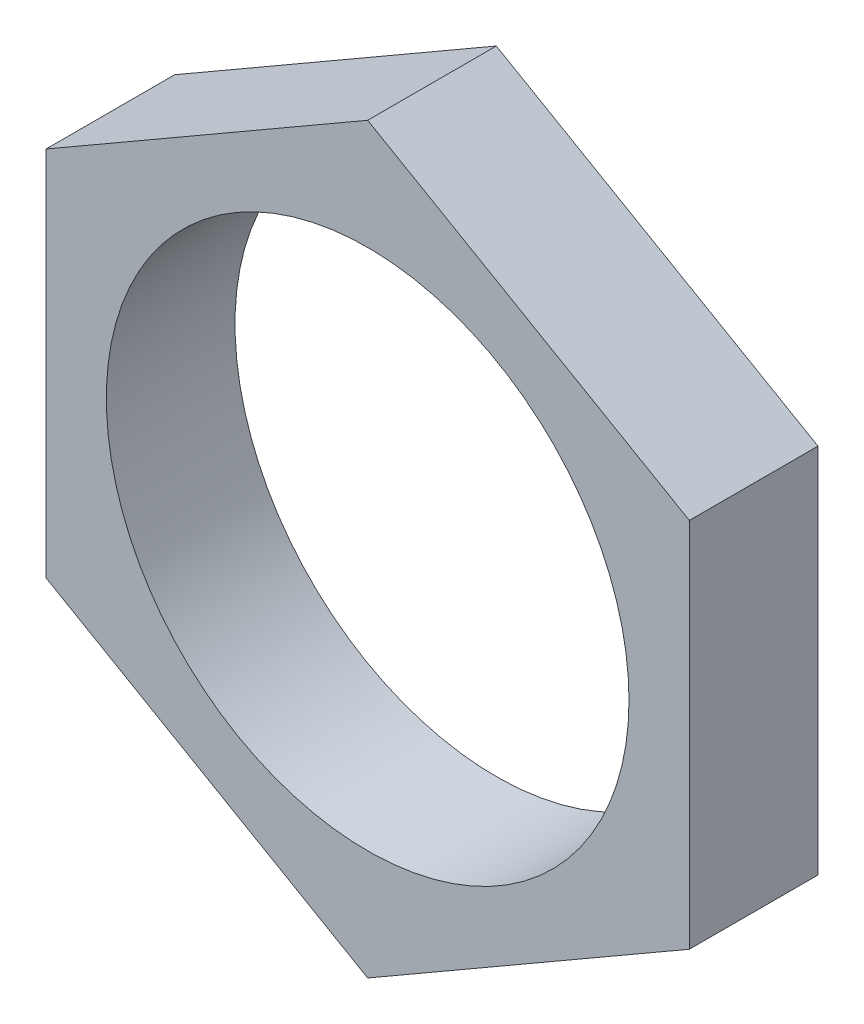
from build123d import *

# Parameters (mm, degrees)
SKETCH1_R      = 16.25
EXTRUDE1_DEPTH = 8


with BuildPart() as part:
    # Sketch1 → Extrude1 (new body)
    with BuildSketch(Plane.XY):
        Polygon((-20, -11.547005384), (0, -23.094010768), (20, -11.547005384), (20, 11.547005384), (0, 23.094010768), (-20, 11.547005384), align=None)
        Circle(SKETCH1_R, mode=Mode.SUBTRACT)
    extrude(amount=EXTRUDE1_DEPTH)


solid = part.part
